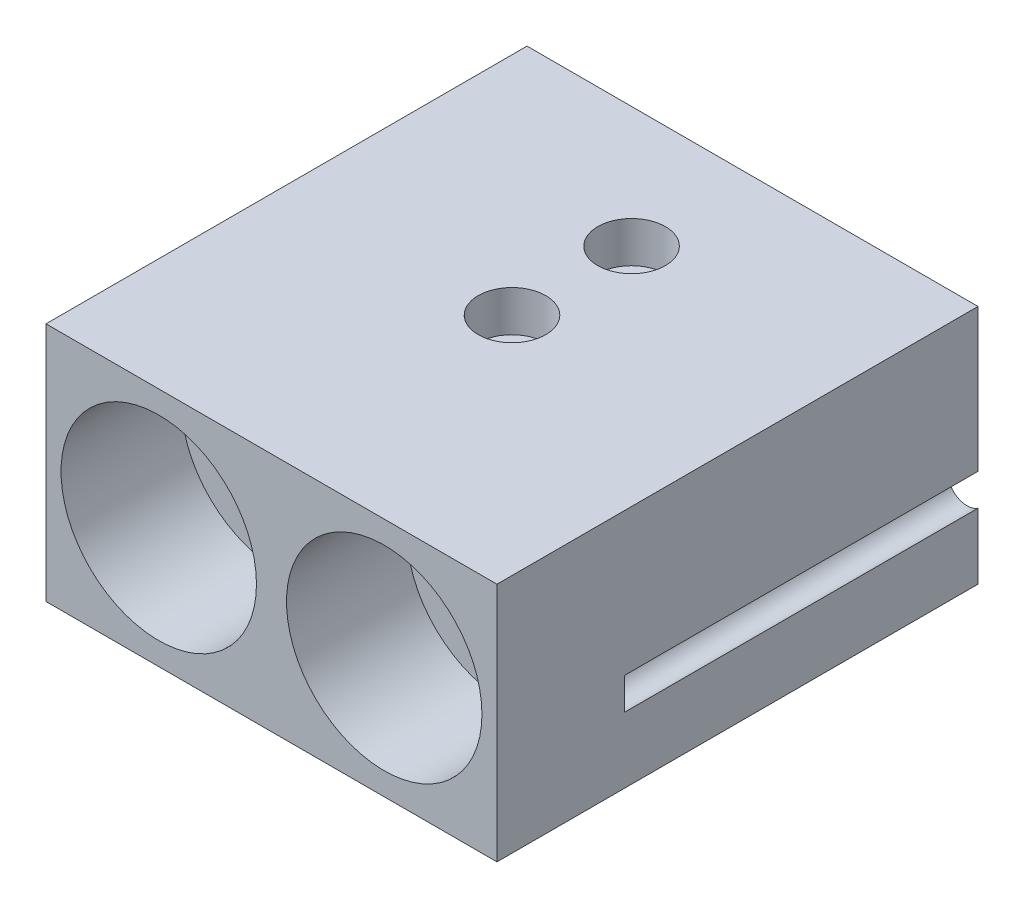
from build123d import *

# Parameters (mm, degrees)
SKETCH1_W                 = 47.625
SKETCH1_H                 = 25.4
EXTRUDE1_DEPTH            = 50.8
SKETCH2_R                 = 7.14375
CUT_EXTRUDE1_DEPTH        = 58.523605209
SKETCH3_R                 = 10.31875
CUT_EXTRUDE2_DEPTH        = 12.7
F_10_32_TAPPED_HOLE1_D    = 4.0386
SKETCH7_R                 = 3.571875
CUT_EXTRUDE3_DEPTH        = 4.318
F_6_32_TAPPED_HOLE1_D     = 2.7051
F_6_32_TAPPED_HOLE1_DEPTH = 13.5128
F_6_32_TAPPED_HOLE1_TIP   = 0.81269403
SKETCH11_R                = 2.0447
CUT_EXTRUDE4_DEPTH        = 37.338
SKETCH12_R                = 1.6129
CUT_EXTRUDE5_DEPTH        = 6.35


with BuildPart() as part:
    # Sketch1 → Extrude1 (new body)
    with BuildSketch(Plane.XY):
        Rectangle(SKETCH1_W, SKETCH1_H)
    extrude(amount=-EXTRUDE1_DEPTH)

    # Sketch2 → Cut-Extrude1 (cut, through all)
    with BuildSketch(Plane.XY):
        with Locations((11.90625, 0)):
            Circle(SKETCH2_R)
        with Locations((-11.90625, 0)):
            Circle(SKETCH2_R)
    extrude(amount=-CUT_EXTRUDE1_DEPTH, mode=Mode.SUBTRACT)

    # Sketch3 → Cut-Extrude2 (cut)
    with BuildSketch(Plane.XY):
        with Locations((11.90625, 0)):
            Circle(SKETCH3_R)
        with Locations((-11.90625, 0)):
            Circle(SKETCH3_R)
    extrude(amount=-CUT_EXTRUDE2_DEPTH, mode=Mode.SUBTRACT)

    # 10-32 Tapped Hole1 (through all)
    with Locations(Plane.XZ.offset(12.7)):
        with Locations((0, -38.1), (0, -25.4)):
            Hole(F_10_32_TAPPED_HOLE1_D / 2)

    # Sketch7 → Cut-Extrude3 (cut)
    with BuildSketch(Plane(origin=(0, 12.7, 0), x_dir=(1, 0, 0), z_dir=(0, 1, 0))):
        with Locations(Location((0, 38.026237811, 0), (0, 0, 270))):
            Circle(SKETCH7_R)
        with Locations(Location((0, 25.4, 0), (0, 0, 270))):
            Circle(SKETCH7_R)
    extrude(amount=-CUT_EXTRUDE3_DEPTH, mode=Mode.SUBTRACT)

    # 6-32 Tapped Hole1
    with Locations(Plane(origin=(0, 0, -50.8), x_dir=(-1, 0, 0), z_dir=(0, 0, -1))):
        with Locations((-19.8374, 8.7122), (19.8374, 8.7122), (19.8374, -8.7376), (-19.8374, -8.7376), (0, 0)):
            Hole(F_6_32_TAPPED_HOLE1_D / 2, depth=F_6_32_TAPPED_HOLE1_DEPTH)
            with Locations((0, 0, -(F_6_32_TAPPED_HOLE1_DEPTH + F_6_32_TAPPED_HOLE1_TIP / 2))):  # 118° drill point
                Cone(0, F_6_32_TAPPED_HOLE1_D / 2, F_6_32_TAPPED_HOLE1_TIP, mode=Mode.SUBTRACT)

    # Sketch11 → Cut-Extrude4 (cut)
    with BuildSketch(Plane(origin=(0, 0, -50.8), x_dir=(-1, 0, 0), z_dir=(0, 0, -1))):
        with Locations((-22.6568, -4.064)):
            Circle(SKETCH11_R)
        with Locations((22.6568, -4.064)):
            Circle(SKETCH11_R)
    extrude(amount=-CUT_EXTRUDE4_DEPTH, mode=Mode.SUBTRACT)

    # Sketch12 → Cut-Extrude5 (cut)
    with BuildSketch(Plane.XZ.offset(12.7)):
        with Locations(Location((21.4376, -31.75, 0), (0, 0, 270))):
            Circle(SKETCH12_R)
        with Locations(Location((-21.4376, -31.75, 0), (0, 0, 270))):
            Circle(SKETCH12_R)
    extrude(amount=-CUT_EXTRUDE5_DEPTH, mode=Mode.SUBTRACT)


solid = part.part
